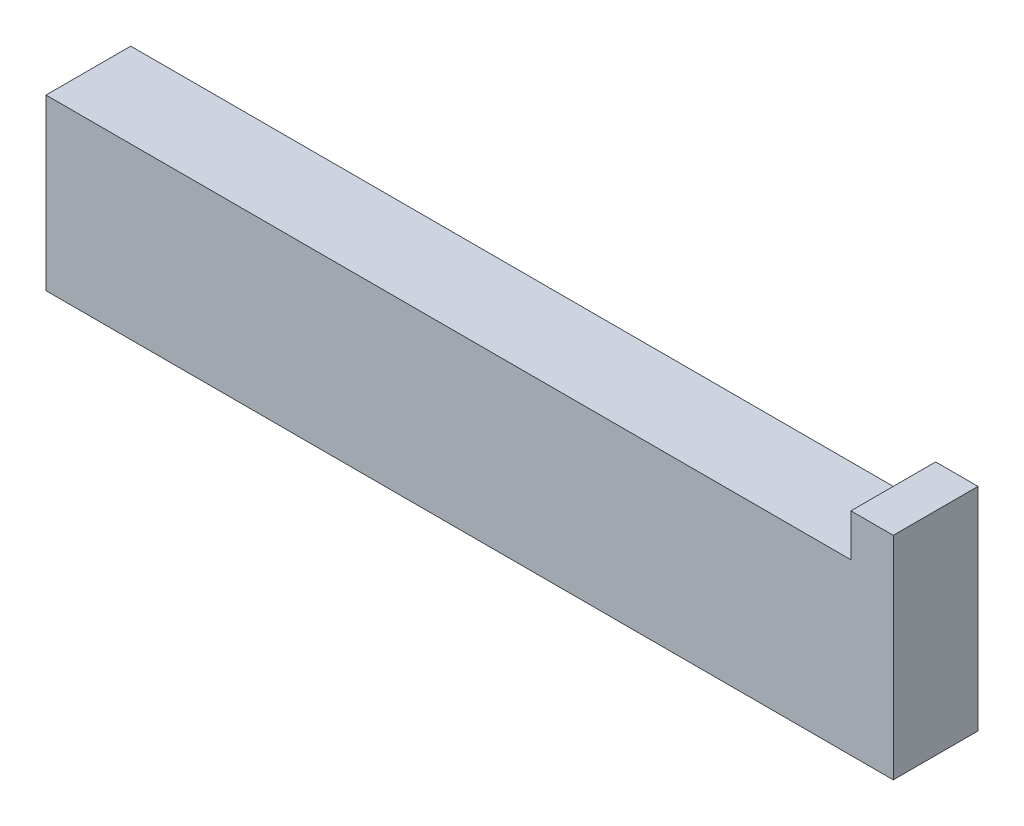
ISO-10303-21;
HEADER;
FILE_DESCRIPTION(('STEP AP214'),'2;1');
FILE_NAME('part.step','',(''),(''),'','','');
FILE_SCHEMA(('AUTOMOTIVE_DESIGN { 1 0 10303 214 1 1 1 1 }'));
ENDSEC;
DATA;
#1=APPLICATION_CONTEXT('core data for automotive mechanical design processes');
#2=APPLICATION_PROTOCOL_DEFINITION('international standard','automotive_design',2000,#1);
#3=PRODUCT_CONTEXT('',#1,'mechanical');
#4=PRODUCT('Part','Part','',(#3));
#5=PRODUCT_RELATED_PRODUCT_CATEGORY('part','',(#4));
#6=PRODUCT_DEFINITION_FORMATION('','',#4);
#7=PRODUCT_DEFINITION_CONTEXT('part definition',#1,'design');
#8=PRODUCT_DEFINITION('design','',#6,#7);
#9=PRODUCT_DEFINITION_SHAPE('','',#8);
#10=(LENGTH_UNIT() NAMED_UNIT(*) SI_UNIT(.MILLI.,.METRE.));
#11=(NAMED_UNIT(*) PLANE_ANGLE_UNIT() SI_UNIT($,.RADIAN.));
#12=(NAMED_UNIT(*) SI_UNIT($,.STERADIAN.) SOLID_ANGLE_UNIT());
#13=UNCERTAINTY_MEASURE_WITH_UNIT(LENGTH_MEASURE(1.E-05),#10,'distance_accuracy_value','');
#14=(GEOMETRIC_REPRESENTATION_CONTEXT(3) GLOBAL_UNCERTAINTY_ASSIGNED_CONTEXT((#13)) GLOBAL_UNIT_ASSIGNED_CONTEXT((#10,
#11,#12)) REPRESENTATION_CONTEXT('',''));
#15=CARTESIAN_POINT('',(0.,0.,0.));
#16=DIRECTION('',(0.,0.,1.));
#17=DIRECTION('',(1.,0.,0.));
#18=AXIS2_PLACEMENT_3D('',#15,#16,#17);
#19=CARTESIAN_POINT('',(-70.7088114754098,19.466393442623,20.));
#20=DIRECTION('',(0.,-1.,0.));
#21=DIRECTION('',(0.,0.,-1.));
#22=AXIS2_PLACEMENT_3D('',#19,#20,#21);
#23=PLANE('',#22);
#24=DIRECTION('',(0.,0.,1.));
#25=VECTOR('',#24,1.);
#26=CARTESIAN_POINT('',(119.29118852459,19.466393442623,20.));
#27=LINE('',#26,#25);
#28=CARTESIAN_POINT('',(119.29118852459,19.466393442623,0.));
#29=VERTEX_POINT('',#28);
#30=CARTESIAN_POINT('',(119.29118852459,19.466393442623,20.));
#31=VERTEX_POINT('',#30);
#32=EDGE_CURVE('E365',#29,#31,#27,.T.);
#33=ORIENTED_EDGE('',*,*,#32,.F.);
#34=DIRECTION('',(-1.,0.,0.));
#35=VECTOR('',#34,1.);
#36=CARTESIAN_POINT('',(-70.7088114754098,19.466393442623,0.));
#37=LINE('',#36,#35);
#38=CARTESIAN_POINT('',(-70.7088114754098,19.466393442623,0.));
#39=VERTEX_POINT('',#38);
#40=EDGE_CURVE('E442',#29,#39,#37,.T.);
#41=ORIENTED_EDGE('',*,*,#40,.T.);
#42=DIRECTION('',(0.,0.,-1.));
#43=VECTOR('',#42,1.);
#44=CARTESIAN_POINT('',(-70.7088114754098,19.466393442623,20.));
#45=LINE('',#44,#43);
#46=CARTESIAN_POINT('',(-70.7088114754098,19.466393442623,20.));
#47=VERTEX_POINT('',#46);
#48=EDGE_CURVE('E402',#47,#39,#45,.T.);
#49=ORIENTED_EDGE('',*,*,#48,.F.);
#50=DIRECTION('',(-1.,0.,0.));
#51=VECTOR('',#50,1.);
#52=CARTESIAN_POINT('',(-70.7088114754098,19.466393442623,20.));
#53=LINE('',#52,#51);
#54=EDGE_CURVE('E372',#31,#47,#53,.T.);
#55=ORIENTED_EDGE('',*,*,#54,.F.);
#56=EDGE_LOOP('',(#33,#41,#49,#55));
#57=FACE_BOUND('',#56,.T.);
#58=ADVANCED_FACE('F348',(#57),#23,.F.);
#59=CARTESIAN_POINT('',(-70.7088114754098,19.466393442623,20.));
#60=DIRECTION('',(1.,0.,0.));
#61=DIRECTION('',(0.,0.,-1.));
#62=AXIS2_PLACEMENT_3D('',#59,#60,#61);
#63=PLANE('',#62);
#64=DIRECTION('',(0.,-1.,0.));
#65=VECTOR('',#64,1.);
#66=CARTESIAN_POINT('',(-70.7088114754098,19.466393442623,0.));
#67=LINE('',#66,#65);
#68=CARTESIAN_POINT('',(-70.7088114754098,-20.5336065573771,0.));
#69=VERTEX_POINT('',#68);
#70=EDGE_CURVE('E421',#39,#69,#67,.T.);
#71=ORIENTED_EDGE('',*,*,#70,.T.);
#72=DIRECTION('',(0.,0.,-1.));
#73=VECTOR('',#72,1.);
#74=CARTESIAN_POINT('',(-70.7088114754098,-20.5336065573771,20.));
#75=LINE('',#74,#73);
#76=CARTESIAN_POINT('',(-70.7088114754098,-20.5336065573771,20.));
#77=VERTEX_POINT('',#76);
#78=EDGE_CURVE('E11',#77,#69,#75,.T.);
#79=ORIENTED_EDGE('',*,*,#78,.F.);
#80=DIRECTION('',(0.,-1.,0.));
#81=VECTOR('',#80,1.);
#82=CARTESIAN_POINT('',(-70.7088114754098,19.466393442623,20.));
#83=LINE('',#82,#81);
#84=EDGE_CURVE('E445',#47,#77,#83,.T.);
#85=ORIENTED_EDGE('',*,*,#84,.F.);
#86=ORIENTED_EDGE('',*,*,#48,.T.);
#87=EDGE_LOOP('',(#71,#79,#85,#86));
#88=FACE_BOUND('',#87,.T.);
#89=ADVANCED_FACE('F350',(#88),#63,.F.);
#90=CARTESIAN_POINT('',(-70.7088114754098,-20.5336065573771,20.));
#91=DIRECTION('',(0.,1.,0.));
#92=DIRECTION('',(0.,0.,1.));
#93=AXIS2_PLACEMENT_3D('',#90,#91,#92);
#94=PLANE('',#93);
#95=DIRECTION('',(1.,0.,0.));
#96=VECTOR('',#95,1.);
#97=CARTESIAN_POINT('',(-70.7088114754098,-20.5336065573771,0.));
#98=LINE('',#97,#96);
#99=CARTESIAN_POINT('',(129.29118852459,-20.5336065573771,0.));
#100=VERTEX_POINT('',#99);
#101=EDGE_CURVE('E438',#69,#100,#98,.T.);
#102=ORIENTED_EDGE('',*,*,#101,.T.);
#103=DIRECTION('',(0.,0.,-1.));
#104=VECTOR('',#103,1.);
#105=CARTESIAN_POINT('',(129.29118852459,-20.5336065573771,20.));
#106=LINE('',#105,#104);
#107=CARTESIAN_POINT('',(129.29118852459,-20.5336065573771,20.));
#108=VERTEX_POINT('',#107);
#109=EDGE_CURVE('E357',#108,#100,#106,.T.);
#110=ORIENTED_EDGE('',*,*,#109,.F.);
#111=DIRECTION('',(1.,0.,0.));
#112=VECTOR('',#111,1.);
#113=CARTESIAN_POINT('',(-70.7088114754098,-20.5336065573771,20.));
#114=LINE('',#113,#112);
#115=EDGE_CURVE('E452',#77,#108,#114,.T.);
#116=ORIENTED_EDGE('',*,*,#115,.F.);
#117=ORIENTED_EDGE('',*,*,#78,.T.);
#118=EDGE_LOOP('',(#102,#110,#116,#117));
#119=FACE_BOUND('',#118,.T.);
#120=ADVANCED_FACE('F458',(#119),#94,.F.);
#121=CARTESIAN_POINT('',(129.29118852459,19.466393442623,20.));
#122=DIRECTION('',(-1.,0.,0.));
#123=DIRECTION('',(0.,0.,1.));
#124=AXIS2_PLACEMENT_3D('',#121,#122,#123);
#125=PLANE('',#124);
#126=DIRECTION('',(0.,1.,0.));
#127=VECTOR('',#126,1.);
#128=CARTESIAN_POINT('',(129.29118852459,19.466393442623,0.));
#129=LINE('',#128,#127);
#130=CARTESIAN_POINT('',(129.29118852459,29.466393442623,0.));
#131=VERTEX_POINT('',#130);
#132=EDGE_CURVE('E440',#100,#131,#129,.T.);
#133=ORIENTED_EDGE('',*,*,#132,.T.);
#134=DIRECTION('',(0.,0.,-1.));
#135=VECTOR('',#134,1.);
#136=CARTESIAN_POINT('',(129.29118852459,29.466393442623,20.));
#137=LINE('',#136,#135);
#138=CARTESIAN_POINT('',(129.29118852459,29.466393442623,20.));
#139=VERTEX_POINT('',#138);
#140=EDGE_CURVE('E415',#139,#131,#137,.T.);
#141=ORIENTED_EDGE('',*,*,#140,.F.);
#142=DIRECTION('',(0.,1.,0.));
#143=VECTOR('',#142,1.);
#144=CARTESIAN_POINT('',(129.29118852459,19.466393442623,20.));
#145=LINE('',#144,#143);
#146=EDGE_CURVE('E404',#108,#139,#145,.T.);
#147=ORIENTED_EDGE('',*,*,#146,.F.);
#148=ORIENTED_EDGE('',*,*,#109,.T.);
#149=EDGE_LOOP('',(#133,#141,#147,#148));
#150=FACE_BOUND('',#149,.T.);
#151=ADVANCED_FACE('F463',(#150),#125,.F.);
#152=CARTESIAN_POINT('',(-70.7088114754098,-20.5336065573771,20.));
#153=DIRECTION('',(0.,0.,1.));
#154=DIRECTION('',(1.,0.,0.));
#155=AXIS2_PLACEMENT_3D('',#152,#153,#154);
#156=PLANE('',#155);
#157=ORIENTED_EDGE('',*,*,#84,.T.);
#158=ORIENTED_EDGE('',*,*,#115,.T.);
#159=ORIENTED_EDGE('',*,*,#146,.T.);
#160=DIRECTION('',(1.,0.,0.));
#161=VECTOR('',#160,1.);
#162=CARTESIAN_POINT('',(129.29118852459,29.466393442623,20.));
#163=LINE('',#162,#161);
#164=CARTESIAN_POINT('',(119.29118852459,29.466393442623,20.));
#165=VERTEX_POINT('',#164);
#166=EDGE_CURVE('E419',#165,#139,#163,.T.);
#167=ORIENTED_EDGE('',*,*,#166,.F.);
#168=DIRECTION('',(0.,-1.,0.));
#169=VECTOR('',#168,1.);
#170=CARTESIAN_POINT('',(119.29118852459,29.466393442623,20.));
#171=LINE('',#170,#169);
#172=EDGE_CURVE('E411',#165,#31,#171,.T.);
#173=ORIENTED_EDGE('',*,*,#172,.T.);
#174=ORIENTED_EDGE('',*,*,#54,.T.);
#175=EDGE_LOOP('',(#157,#158,#159,#167,#173,#174));
#176=FACE_BOUND('',#175,.T.);
#177=ADVANCED_FACE('F417',(#176),#156,.T.);
#178=CARTESIAN_POINT('',(-70.7088114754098,-20.5336065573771,0.));
#179=DIRECTION('',(0.,0.,1.));
#180=DIRECTION('',(1.,0.,0.));
#181=AXIS2_PLACEMENT_3D('',#178,#179,#180);
#182=PLANE('',#181);
#183=ORIENTED_EDGE('',*,*,#70,.F.);
#184=ORIENTED_EDGE('',*,*,#40,.F.);
#185=DIRECTION('',(0.,-1.,0.));
#186=VECTOR('',#185,1.);
#187=CARTESIAN_POINT('',(119.29118852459,29.466393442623,0.));
#188=LINE('',#187,#186);
#189=CARTESIAN_POINT('',(119.29118852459,29.466393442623,0.));
#190=VERTEX_POINT('',#189);
#191=EDGE_CURVE('E414',#190,#29,#188,.T.);
#192=ORIENTED_EDGE('',*,*,#191,.F.);
#193=DIRECTION('',(-1.,0.,0.));
#194=VECTOR('',#193,1.);
#195=CARTESIAN_POINT('',(129.29118852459,29.466393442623,0.));
#196=LINE('',#195,#194);
#197=EDGE_CURVE('E433',#131,#190,#196,.T.);
#198=ORIENTED_EDGE('',*,*,#197,.F.);
#199=ORIENTED_EDGE('',*,*,#132,.F.);
#200=ORIENTED_EDGE('',*,*,#101,.F.);
#201=EDGE_LOOP('',(#183,#184,#192,#198,#199,#200));
#202=FACE_BOUND('',#201,.T.);
#203=ADVANCED_FACE('F468',(#202),#182,.F.);
#204=CARTESIAN_POINT('',(119.29118852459,29.466393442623,20.));
#205=DIRECTION('',(1.,0.,0.));
#206=DIRECTION('',(0.,0.,-1.));
#207=AXIS2_PLACEMENT_3D('',#204,#205,#206);
#208=PLANE('',#207);
#209=ORIENTED_EDGE('',*,*,#32,.T.);
#210=ORIENTED_EDGE('',*,*,#172,.F.);
#211=DIRECTION('',(0.,0.,1.));
#212=VECTOR('',#211,1.);
#213=CARTESIAN_POINT('',(119.29118852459,29.466393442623,20.));
#214=LINE('',#213,#212);
#215=EDGE_CURVE('E422',#190,#165,#214,.T.);
#216=ORIENTED_EDGE('',*,*,#215,.F.);
#217=ORIENTED_EDGE('',*,*,#191,.T.);
#218=EDGE_LOOP('',(#209,#210,#216,#217));
#219=FACE_BOUND('',#218,.T.);
#220=ADVANCED_FACE('F409',(#219),#208,.F.);
#221=CARTESIAN_POINT('',(129.29118852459,29.466393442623,0.));
#222=DIRECTION('',(0.,1.,0.));
#223=DIRECTION('',(0.,0.,1.));
#224=AXIS2_PLACEMENT_3D('',#221,#222,#223);
#225=PLANE('',#224);
#226=ORIENTED_EDGE('',*,*,#140,.T.);
#227=ORIENTED_EDGE('',*,*,#197,.T.);
#228=ORIENTED_EDGE('',*,*,#215,.T.);
#229=ORIENTED_EDGE('',*,*,#166,.T.);
#230=EDGE_LOOP('',(#226,#227,#228,#229));
#231=FACE_BOUND('',#230,.T.);
#232=ADVANCED_FACE('F465',(#231),#225,.T.);
#233=CLOSED_SHELL('',(#58,#89,#120,#151,#177,#203,#220,#232));
#234=MANIFOLD_SOLID_BREP('B2',#233);
#235=ADVANCED_BREP_SHAPE_REPRESENTATION('',(#18,#234),#14);
#236=SHAPE_DEFINITION_REPRESENTATION(#9,#235);
ENDSEC;
END-ISO-10303-21;
